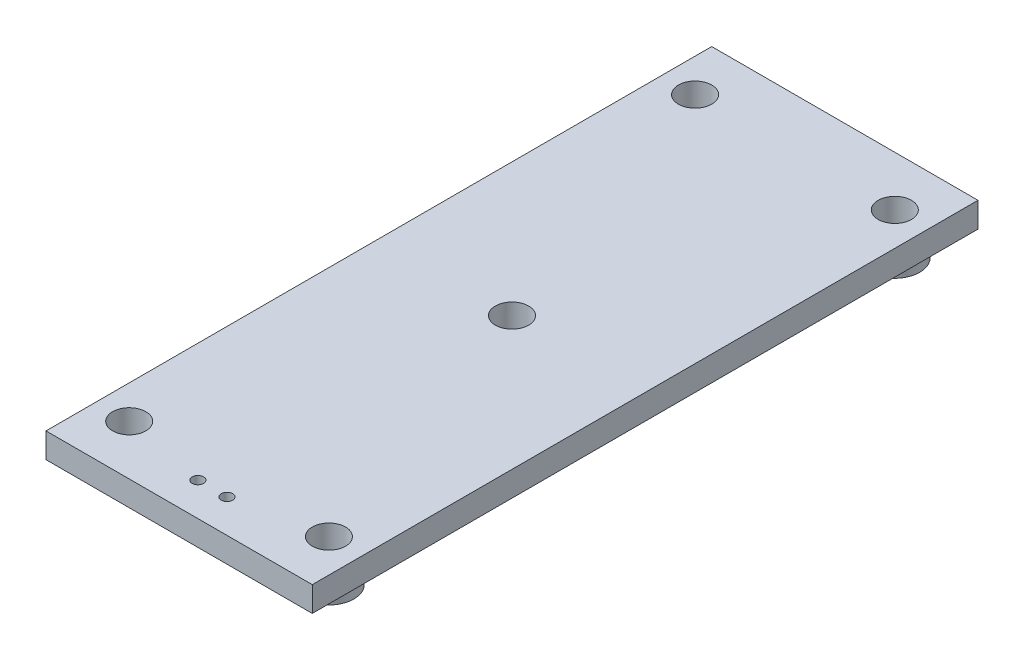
ISO-10303-21;
HEADER;
FILE_DESCRIPTION(('STEP AP214'),'2;1');
FILE_NAME('part.step','',(''),(''),'','','');
FILE_SCHEMA(('AUTOMOTIVE_DESIGN { 1 0 10303 214 1 1 1 1 }'));
ENDSEC;
DATA;
#1=APPLICATION_CONTEXT('core data for automotive mechanical design processes');
#2=APPLICATION_PROTOCOL_DEFINITION('international standard','automotive_design',2000,#1);
#3=PRODUCT_CONTEXT('',#1,'mechanical');
#4=PRODUCT('Part','Part','',(#3));
#5=PRODUCT_RELATED_PRODUCT_CATEGORY('part','',(#4));
#6=PRODUCT_DEFINITION_FORMATION('','',#4);
#7=PRODUCT_DEFINITION_CONTEXT('part definition',#1,'design');
#8=PRODUCT_DEFINITION('design','',#6,#7);
#9=PRODUCT_DEFINITION_SHAPE('','',#8);
#10=(LENGTH_UNIT() NAMED_UNIT(*) SI_UNIT(.MILLI.,.METRE.));
#11=(NAMED_UNIT(*) PLANE_ANGLE_UNIT() SI_UNIT($,.RADIAN.));
#12=(NAMED_UNIT(*) SI_UNIT($,.STERADIAN.) SOLID_ANGLE_UNIT());
#13=UNCERTAINTY_MEASURE_WITH_UNIT(LENGTH_MEASURE(1.E-05),#10,'distance_accuracy_value','');
#14=(GEOMETRIC_REPRESENTATION_CONTEXT(3) GLOBAL_UNCERTAINTY_ASSIGNED_CONTEXT((#13)) GLOBAL_UNIT_ASSIGNED_CONTEXT((#10,
#11,#12)) REPRESENTATION_CONTEXT('',''));
#15=CARTESIAN_POINT('',(0.,0.,0.));
#16=DIRECTION('',(0.,0.,1.));
#17=DIRECTION('',(1.,0.,0.));
#18=AXIS2_PLACEMENT_3D('',#15,#16,#17);
#19=CARTESIAN_POINT('',(101.6,0.,0.));
#20=DIRECTION('',(0.,-1.,0.));
#21=DIRECTION('',(0.,0.,-1.));
#22=AXIS2_PLACEMENT_3D('',#19,#20,#21);
#23=PLANE('',#22);
#24=CARTESIAN_POINT('',(-11.1125000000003,0.,482.6));
#25=DIRECTION('',(0.,-1.,0.));
#26=DIRECTION('',(0.,0.,-1.));
#27=AXIS2_PLACEMENT_3D('',#24,#25,#26);
#28=CIRCLE('',#27,4.365625);
#29=CARTESIAN_POINT('',(-11.1125000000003,0.,478.234375));
#30=VERTEX_POINT('',#29);
#31=EDGE_CURVE('E303',#30,#30,#28,.T.);
#32=ORIENTED_EDGE('',*,*,#31,.F.);
#33=EDGE_LOOP('',(#32));
#34=FACE_BOUND('',#33,.T.);
#35=CARTESIAN_POINT('',(11.1124999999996,0.,482.6));
#36=DIRECTION('',(0.,-1.,0.));
#37=DIRECTION('',(0.,0.,-1.));
#38=AXIS2_PLACEMENT_3D('',#35,#36,#37);
#39=CIRCLE('',#38,4.365625);
#40=CARTESIAN_POINT('',(11.1124999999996,0.,478.234375));
#41=VERTEX_POINT('',#40);
#42=EDGE_CURVE('E305',#41,#41,#39,.T.);
#43=ORIENTED_EDGE('',*,*,#42,.F.);
#44=EDGE_LOOP('',(#43));
#45=FACE_BOUND('',#44,.T.);
#46=CARTESIAN_POINT('',(0.,0.,254.));
#47=DIRECTION('',(0.,-1.,0.));
#48=DIRECTION('',(0.,0.,-1.));
#49=AXIS2_PLACEMENT_3D('',#46,#47,#48);
#50=CIRCLE('',#49,12.7);
#51=CARTESIAN_POINT('',(0.,0.,241.3));
#52=VERTEX_POINT('',#51);
#53=EDGE_CURVE('E316',#52,#52,#50,.T.);
#54=ORIENTED_EDGE('',*,*,#53,.F.);
#55=EDGE_LOOP('',(#54));
#56=FACE_BOUND('',#55,.T.);
#57=CARTESIAN_POINT('',(-76.2000000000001,0.,469.9));
#58=DIRECTION('',(0.,-1.,0.));
#59=DIRECTION('',(0.,0.,-1.));
#60=AXIS2_PLACEMENT_3D('',#57,#58,#59);
#61=CIRCLE('',#60,19.05);
#62=CARTESIAN_POINT('',(-76.2000000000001,0.,450.85));
#63=VERTEX_POINT('',#62);
#64=EDGE_CURVE('E11',#63,#63,#61,.T.);
#65=ORIENTED_EDGE('',*,*,#64,.F.);
#66=EDGE_LOOP('',(#65));
#67=FACE_BOUND('',#66,.T.);
#68=CARTESIAN_POINT('',(76.1999999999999,0.,469.9));
#69=DIRECTION('',(0.,-1.,0.));
#70=DIRECTION('',(0.,0.,-1.));
#71=AXIS2_PLACEMENT_3D('',#68,#69,#70);
#72=CIRCLE('',#71,19.05);
#73=CARTESIAN_POINT('',(76.1999999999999,0.,450.85));
#74=VERTEX_POINT('',#73);
#75=EDGE_CURVE('E95',#74,#74,#72,.T.);
#76=ORIENTED_EDGE('',*,*,#75,.F.);
#77=EDGE_LOOP('',(#76));
#78=FACE_BOUND('',#77,.T.);
#79=DIRECTION('',(0.,0.,1.));
#80=VECTOR('',#79,1.);
#81=CARTESIAN_POINT('',(101.6,0.,0.));
#82=LINE('',#81,#80);
#83=CARTESIAN_POINT('',(101.6,0.,0.));
#84=VERTEX_POINT('',#83);
#85=CARTESIAN_POINT('',(101.6,0.,508.));
#86=VERTEX_POINT('',#85);
#87=EDGE_CURVE('E74',#84,#86,#82,.T.);
#88=ORIENTED_EDGE('',*,*,#87,.T.);
#89=DIRECTION('',(1.,0.,0.));
#90=VECTOR('',#89,1.);
#91=CARTESIAN_POINT('',(-101.6,0.,508.));
#92=LINE('',#91,#90);
#93=CARTESIAN_POINT('',(-101.6,0.,508.));
#94=VERTEX_POINT('',#93);
#95=EDGE_CURVE('E81',#94,#86,#92,.T.);
#96=ORIENTED_EDGE('',*,*,#95,.F.);
#97=DIRECTION('',(0.,0.,-1.));
#98=VECTOR('',#97,1.);
#99=CARTESIAN_POINT('',(-101.6,0.,508.));
#100=LINE('',#99,#98);
#101=CARTESIAN_POINT('',(-101.6,0.,0.));
#102=VERTEX_POINT('',#101);
#103=EDGE_CURVE('E86',#94,#102,#100,.T.);
#104=ORIENTED_EDGE('',*,*,#103,.T.);
#105=DIRECTION('',(-1.,0.,0.));
#106=VECTOR('',#105,1.);
#107=CARTESIAN_POINT('',(101.6,0.,0.));
#108=LINE('',#107,#106);
#109=EDGE_CURVE('E91',#84,#102,#108,.T.);
#110=ORIENTED_EDGE('',*,*,#109,.F.);
#111=EDGE_LOOP('',(#88,#96,#104,#110));
#112=FACE_BOUND('',#111,.T.);
#113=CARTESIAN_POINT('',(76.1999999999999,0.,38.1));
#114=DIRECTION('',(0.,-1.,0.));
#115=DIRECTION('',(0.,0.,-1.));
#116=AXIS2_PLACEMENT_3D('',#113,#114,#115);
#117=CIRCLE('',#116,19.05);
#118=CARTESIAN_POINT('',(76.1999999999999,0.,19.05));
#119=VERTEX_POINT('',#118);
#120=EDGE_CURVE('E38',#119,#119,#117,.T.);
#121=ORIENTED_EDGE('',*,*,#120,.F.);
#122=EDGE_LOOP('',(#121));
#123=FACE_BOUND('',#122,.T.);
#124=CARTESIAN_POINT('',(-76.2000000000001,0.,38.1));
#125=DIRECTION('',(0.,-1.,0.));
#126=DIRECTION('',(0.,0.,-1.));
#127=AXIS2_PLACEMENT_3D('',#124,#125,#126);
#128=CIRCLE('',#127,19.05);
#129=CARTESIAN_POINT('',(-76.2000000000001,0.,19.05));
#130=VERTEX_POINT('',#129);
#131=EDGE_CURVE('E121',#130,#130,#128,.T.);
#132=ORIENTED_EDGE('',*,*,#131,.F.);
#133=EDGE_LOOP('',(#132));
#134=FACE_BOUND('',#133,.T.);
#135=ADVANCED_FACE('F30',(#34,#45,#56,#67,#78,#112,#123,#134),#23,.T.);
#136=CARTESIAN_POINT('',(101.6,19.05,0.));
#137=DIRECTION('',(1.,0.,0.));
#138=DIRECTION('',(0.,0.,-1.));
#139=AXIS2_PLACEMENT_3D('',#136,#137,#138);
#140=PLANE('',#139);
#141=ORIENTED_EDGE('',*,*,#87,.F.);
#142=DIRECTION('',(0.,-1.,0.));
#143=VECTOR('',#142,1.);
#144=CARTESIAN_POINT('',(101.6,19.05,0.));
#145=LINE('',#144,#143);
#146=CARTESIAN_POINT('',(101.6,19.05,0.));
#147=VERTEX_POINT('',#146);
#148=EDGE_CURVE('E45',#147,#84,#145,.T.);
#149=ORIENTED_EDGE('',*,*,#148,.F.);
#150=DIRECTION('',(0.,0.,1.));
#151=VECTOR('',#150,1.);
#152=CARTESIAN_POINT('',(101.6,19.05,0.));
#153=LINE('',#152,#151);
#154=CARTESIAN_POINT('',(101.6,19.05,508.));
#155=VERTEX_POINT('',#154);
#156=EDGE_CURVE('E75',#147,#155,#153,.T.);
#157=ORIENTED_EDGE('',*,*,#156,.T.);
#158=DIRECTION('',(0.,-1.,0.));
#159=VECTOR('',#158,1.);
#160=CARTESIAN_POINT('',(101.6,19.05,508.));
#161=LINE('',#160,#159);
#162=EDGE_CURVE('E71',#155,#86,#161,.T.);
#163=ORIENTED_EDGE('',*,*,#162,.T.);
#164=EDGE_LOOP('',(#141,#149,#157,#163));
#165=FACE_BOUND('',#164,.T.);
#166=ADVANCED_FACE('F32',(#165),#140,.T.);
#167=CARTESIAN_POINT('',(101.6,19.05,0.));
#168=DIRECTION('',(0.,0.,1.));
#169=DIRECTION('',(1.,0.,0.));
#170=AXIS2_PLACEMENT_3D('',#167,#168,#169);
#171=PLANE('',#170);
#172=ORIENTED_EDGE('',*,*,#109,.T.);
#173=DIRECTION('',(0.,-1.,0.));
#174=VECTOR('',#173,1.);
#175=CARTESIAN_POINT('',(-101.6,19.05,0.));
#176=LINE('',#175,#174);
#177=CARTESIAN_POINT('',(-101.6,19.05,0.));
#178=VERTEX_POINT('',#177);
#179=EDGE_CURVE('E109',#178,#102,#176,.T.);
#180=ORIENTED_EDGE('',*,*,#179,.F.);
#181=DIRECTION('',(-1.,0.,0.));
#182=VECTOR('',#181,1.);
#183=CARTESIAN_POINT('',(101.6,19.05,0.));
#184=LINE('',#183,#182);
#185=EDGE_CURVE('E52',#147,#178,#184,.T.);
#186=ORIENTED_EDGE('',*,*,#185,.F.);
#187=ORIENTED_EDGE('',*,*,#148,.T.);
#188=EDGE_LOOP('',(#172,#180,#186,#187));
#189=FACE_BOUND('',#188,.T.);
#190=ADVANCED_FACE('F158',(#189),#171,.F.);
#191=CARTESIAN_POINT('',(-101.6,19.05,508.));
#192=DIRECTION('',(-1.,0.,0.));
#193=DIRECTION('',(0.,0.,1.));
#194=AXIS2_PLACEMENT_3D('',#191,#192,#193);
#195=PLANE('',#194);
#196=ORIENTED_EDGE('',*,*,#103,.F.);
#197=DIRECTION('',(0.,-1.,0.));
#198=VECTOR('',#197,1.);
#199=CARTESIAN_POINT('',(-101.6,19.05,508.));
#200=LINE('',#199,#198);
#201=CARTESIAN_POINT('',(-101.6,19.05,508.));
#202=VERTEX_POINT('',#201);
#203=EDGE_CURVE('E78',#202,#94,#200,.T.);
#204=ORIENTED_EDGE('',*,*,#203,.F.);
#205=DIRECTION('',(0.,0.,-1.));
#206=VECTOR('',#205,1.);
#207=CARTESIAN_POINT('',(-101.6,19.05,508.));
#208=LINE('',#207,#206);
#209=EDGE_CURVE('E104',#202,#178,#208,.T.);
#210=ORIENTED_EDGE('',*,*,#209,.T.);
#211=ORIENTED_EDGE('',*,*,#179,.T.);
#212=EDGE_LOOP('',(#196,#204,#210,#211));
#213=FACE_BOUND('',#212,.T.);
#214=ADVANCED_FACE('F161',(#213),#195,.T.);
#215=CARTESIAN_POINT('',(-101.6,19.05,508.));
#216=DIRECTION('',(0.,0.,-1.));
#217=DIRECTION('',(-1.,0.,0.));
#218=AXIS2_PLACEMENT_3D('',#215,#216,#217);
#219=PLANE('',#218);
#220=ORIENTED_EDGE('',*,*,#95,.T.);
#221=ORIENTED_EDGE('',*,*,#162,.F.);
#222=DIRECTION('',(1.,0.,0.));
#223=VECTOR('',#222,1.);
#224=CARTESIAN_POINT('',(-101.6,19.05,508.));
#225=LINE('',#224,#223);
#226=EDGE_CURVE('E102',#202,#155,#225,.T.);
#227=ORIENTED_EDGE('',*,*,#226,.F.);
#228=ORIENTED_EDGE('',*,*,#203,.T.);
#229=EDGE_LOOP('',(#220,#221,#227,#228));
#230=FACE_BOUND('',#229,.T.);
#231=ADVANCED_FACE('F82',(#230),#219,.F.);
#232=CARTESIAN_POINT('',(101.6,19.05,0.));
#233=DIRECTION('',(0.,-1.,0.));
#234=DIRECTION('',(0.,0.,-1.));
#235=AXIS2_PLACEMENT_3D('',#232,#233,#234);
#236=PLANE('',#235);
#237=CARTESIAN_POINT('',(-11.1125000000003,19.05,482.6));
#238=DIRECTION('',(0.,-1.,0.));
#239=DIRECTION('',(0.,0.,-1.));
#240=AXIS2_PLACEMENT_3D('',#237,#238,#239);
#241=CIRCLE('',#240,4.365625);
#242=CARTESIAN_POINT('',(-11.1125000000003,19.05,478.234375));
#243=VERTEX_POINT('',#242);
#244=EDGE_CURVE('E300',#243,#243,#241,.T.);
#245=ORIENTED_EDGE('',*,*,#244,.T.);
#246=EDGE_LOOP('',(#245));
#247=FACE_BOUND('',#246,.T.);
#248=CARTESIAN_POINT('',(11.1124999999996,19.05,482.6));
#249=DIRECTION('',(0.,-1.,0.));
#250=DIRECTION('',(0.,0.,-1.));
#251=AXIS2_PLACEMENT_3D('',#248,#249,#250);
#252=CIRCLE('',#251,4.365625);
#253=CARTESIAN_POINT('',(11.1124999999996,19.05,478.234375));
#254=VERTEX_POINT('',#253);
#255=EDGE_CURVE('E310',#254,#254,#252,.T.);
#256=ORIENTED_EDGE('',*,*,#255,.T.);
#257=EDGE_LOOP('',(#256));
#258=FACE_BOUND('',#257,.T.);
#259=CARTESIAN_POINT('',(0.,19.05,254.));
#260=DIRECTION('',(0.,1.,0.));
#261=DIRECTION('',(0.,0.,1.));
#262=AXIS2_PLACEMENT_3D('',#259,#260,#261);
#263=CIRCLE('',#262,12.7);
#264=CARTESIAN_POINT('',(0.,19.05,266.7));
#265=VERTEX_POINT('',#264);
#266=EDGE_CURVE('E313',#265,#265,#263,.T.);
#267=ORIENTED_EDGE('',*,*,#266,.F.);
#268=EDGE_LOOP('',(#267));
#269=FACE_BOUND('',#268,.T.);
#270=CARTESIAN_POINT('',(-76.2000000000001,19.05,38.1));
#271=DIRECTION('',(0.,-1.,0.));
#272=DIRECTION('',(0.,0.,-1.));
#273=AXIS2_PLACEMENT_3D('',#270,#271,#272);
#274=CIRCLE('',#273,12.7);
#275=CARTESIAN_POINT('',(-76.2000000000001,19.05,25.4));
#276=VERTEX_POINT('',#275);
#277=EDGE_CURVE('E322',#276,#276,#274,.T.);
#278=ORIENTED_EDGE('',*,*,#277,.T.);
#279=EDGE_LOOP('',(#278));
#280=FACE_BOUND('',#279,.T.);
#281=CARTESIAN_POINT('',(76.1999999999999,19.05,38.1));
#282=DIRECTION('',(0.,-1.,0.));
#283=DIRECTION('',(0.,0.,-1.));
#284=AXIS2_PLACEMENT_3D('',#281,#282,#283);
#285=CIRCLE('',#284,12.7);
#286=CARTESIAN_POINT('',(76.1999999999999,19.05,25.4));
#287=VERTEX_POINT('',#286);
#288=EDGE_CURVE('E328',#287,#287,#285,.T.);
#289=ORIENTED_EDGE('',*,*,#288,.T.);
#290=EDGE_LOOP('',(#289));
#291=FACE_BOUND('',#290,.T.);
#292=CARTESIAN_POINT('',(-76.2000000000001,19.05,469.9));
#293=DIRECTION('',(0.,-1.,0.));
#294=DIRECTION('',(0.,0.,-1.));
#295=AXIS2_PLACEMENT_3D('',#292,#293,#294);
#296=CIRCLE('',#295,12.7);
#297=CARTESIAN_POINT('',(-76.2000000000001,19.05,457.2));
#298=VERTEX_POINT('',#297);
#299=EDGE_CURVE('E334',#298,#298,#296,.T.);
#300=ORIENTED_EDGE('',*,*,#299,.T.);
#301=EDGE_LOOP('',(#300));
#302=FACE_BOUND('',#301,.T.);
#303=CARTESIAN_POINT('',(76.1999999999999,19.05,469.9));
#304=DIRECTION('',(0.,-1.,0.));
#305=DIRECTION('',(0.,0.,-1.));
#306=AXIS2_PLACEMENT_3D('',#303,#304,#305);
#307=CIRCLE('',#306,12.7);
#308=CARTESIAN_POINT('',(76.1999999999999,19.05,457.2));
#309=VERTEX_POINT('',#308);
#310=EDGE_CURVE('E130',#309,#309,#307,.T.);
#311=ORIENTED_EDGE('',*,*,#310,.T.);
#312=EDGE_LOOP('',(#311));
#313=FACE_BOUND('',#312,.T.);
#314=ORIENTED_EDGE('',*,*,#156,.F.);
#315=ORIENTED_EDGE('',*,*,#185,.T.);
#316=ORIENTED_EDGE('',*,*,#209,.F.);
#317=ORIENTED_EDGE('',*,*,#226,.T.);
#318=EDGE_LOOP('',(#314,#315,#316,#317));
#319=FACE_BOUND('',#318,.T.);
#320=ADVANCED_FACE('F142',(#247,#258,#269,#280,#291,#302,#313,#319),#236,.F.);
#321=CARTESIAN_POINT('',(76.1999999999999,-12.7,469.9));
#322=DIRECTION('',(0.,1.,0.));
#323=DIRECTION('',(0.,0.,1.));
#324=AXIS2_PLACEMENT_3D('',#321,#322,#323);
#325=CYLINDRICAL_SURFACE('',#324,19.05);
#326=CARTESIAN_POINT('',(76.1999999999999,-12.7,469.9));
#327=DIRECTION('',(0.,-1.,0.));
#328=DIRECTION('',(0.,0.,-1.));
#329=AXIS2_PLACEMENT_3D('',#326,#327,#328);
#330=CIRCLE('',#329,19.05);
#331=CARTESIAN_POINT('',(76.1999999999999,-12.7,450.85));
#332=VERTEX_POINT('',#331);
#333=EDGE_CURVE('E92',#332,#332,#330,.T.);
#334=ORIENTED_EDGE('',*,*,#333,.F.);
#335=EDGE_LOOP('',(#334));
#336=FACE_BOUND('',#335,.T.);
#337=ORIENTED_EDGE('',*,*,#75,.T.);
#338=EDGE_LOOP('',(#337));
#339=FACE_BOUND('',#338,.T.);
#340=ADVANCED_FACE('F138',(#336,#339),#325,.T.);
#341=CARTESIAN_POINT('',(76.1999999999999,-12.7,469.9));
#342=DIRECTION('',(0.,-1.,0.));
#343=DIRECTION('',(0.,0.,-1.));
#344=AXIS2_PLACEMENT_3D('',#341,#342,#343);
#345=PLANE('',#344);
#346=CARTESIAN_POINT('',(76.1999999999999,-12.7,469.9));
#347=DIRECTION('',(0.,-1.,0.));
#348=DIRECTION('',(0.,0.,-1.));
#349=AXIS2_PLACEMENT_3D('',#346,#347,#348);
#350=CIRCLE('',#349,12.7);
#351=CARTESIAN_POINT('',(76.1999999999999,-12.7,457.2));
#352=VERTEX_POINT('',#351);
#353=EDGE_CURVE('E337',#352,#352,#350,.T.);
#354=ORIENTED_EDGE('',*,*,#353,.F.);
#355=EDGE_LOOP('',(#354));
#356=FACE_BOUND('',#355,.T.);
#357=ORIENTED_EDGE('',*,*,#333,.T.);
#358=EDGE_LOOP('',(#357));
#359=FACE_BOUND('',#358,.T.);
#360=ADVANCED_FACE('F141',(#356,#359),#345,.T.);
#361=CARTESIAN_POINT('',(76.1999999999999,-12.7,38.1));
#362=DIRECTION('',(0.,1.,0.));
#363=DIRECTION('',(0.,0.,1.));
#364=AXIS2_PLACEMENT_3D('',#361,#362,#363);
#365=CYLINDRICAL_SURFACE('',#364,19.05);
#366=CARTESIAN_POINT('',(76.1999999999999,-12.7,38.1));
#367=DIRECTION('',(0.,1.,0.));
#368=DIRECTION('',(0.,0.,1.));
#369=AXIS2_PLACEMENT_3D('',#366,#367,#368);
#370=CIRCLE('',#369,19.05);
#371=CARTESIAN_POINT('',(76.1999999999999,-12.7,57.15));
#372=VERTEX_POINT('',#371);
#373=EDGE_CURVE('E127',#372,#372,#370,.T.);
#374=ORIENTED_EDGE('',*,*,#373,.T.);
#375=EDGE_LOOP('',(#374));
#376=FACE_BOUND('',#375,.T.);
#377=ORIENTED_EDGE('',*,*,#120,.T.);
#378=EDGE_LOOP('',(#377));
#379=FACE_BOUND('',#378,.T.);
#380=ADVANCED_FACE('F114',(#376,#379),#365,.T.);
#381=CARTESIAN_POINT('',(76.1999999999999,-12.7,38.1));
#382=DIRECTION('',(0.,1.,0.));
#383=DIRECTION('',(0.,0.,1.));
#384=AXIS2_PLACEMENT_3D('',#381,#382,#383);
#385=PLANE('',#384);
#386=CARTESIAN_POINT('',(76.1999999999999,-12.7,38.1));
#387=DIRECTION('',(0.,-1.,0.));
#388=DIRECTION('',(0.,0.,-1.));
#389=AXIS2_PLACEMENT_3D('',#386,#387,#388);
#390=CIRCLE('',#389,12.7);
#391=CARTESIAN_POINT('',(76.1999999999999,-12.7,25.4));
#392=VERTEX_POINT('',#391);
#393=EDGE_CURVE('E325',#392,#392,#390,.T.);
#394=ORIENTED_EDGE('',*,*,#393,.F.);
#395=EDGE_LOOP('',(#394));
#396=FACE_BOUND('',#395,.T.);
#397=ORIENTED_EDGE('',*,*,#373,.F.);
#398=EDGE_LOOP('',(#397));
#399=FACE_BOUND('',#398,.T.);
#400=ADVANCED_FACE('F204',(#396,#399),#385,.F.);
#401=CARTESIAN_POINT('',(-76.2000000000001,-12.7,38.1));
#402=DIRECTION('',(0.,1.,0.));
#403=DIRECTION('',(0.,0.,1.));
#404=AXIS2_PLACEMENT_3D('',#401,#402,#403);
#405=CYLINDRICAL_SURFACE('',#404,19.05);
#406=CARTESIAN_POINT('',(-76.2000000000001,-12.7,38.1));
#407=DIRECTION('',(0.,-1.,0.));
#408=DIRECTION('',(0.,0.,-1.));
#409=AXIS2_PLACEMENT_3D('',#406,#407,#408);
#410=CIRCLE('',#409,19.05);
#411=CARTESIAN_POINT('',(-76.2000000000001,-12.7,19.05));
#412=VERTEX_POINT('',#411);
#413=EDGE_CURVE('E123',#412,#412,#410,.T.);
#414=ORIENTED_EDGE('',*,*,#413,.F.);
#415=EDGE_LOOP('',(#414));
#416=FACE_BOUND('',#415,.T.);
#417=ORIENTED_EDGE('',*,*,#131,.T.);
#418=EDGE_LOOP('',(#417));
#419=FACE_BOUND('',#418,.T.);
#420=ADVANCED_FACE('F211',(#416,#419),#405,.T.);
#421=CARTESIAN_POINT('',(-76.2000000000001,-12.7,38.1));
#422=DIRECTION('',(0.,-1.,0.));
#423=DIRECTION('',(0.,0.,-1.));
#424=AXIS2_PLACEMENT_3D('',#421,#422,#423);
#425=PLANE('',#424);
#426=CARTESIAN_POINT('',(-76.2000000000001,-12.7,38.1));
#427=DIRECTION('',(0.,-1.,0.));
#428=DIRECTION('',(0.,0.,-1.));
#429=AXIS2_PLACEMENT_3D('',#426,#427,#428);
#430=CIRCLE('',#429,12.7);
#431=CARTESIAN_POINT('',(-76.2000000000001,-12.7,25.4));
#432=VERTEX_POINT('',#431);
#433=EDGE_CURVE('E319',#432,#432,#430,.T.);
#434=ORIENTED_EDGE('',*,*,#433,.F.);
#435=EDGE_LOOP('',(#434));
#436=FACE_BOUND('',#435,.T.);
#437=ORIENTED_EDGE('',*,*,#413,.T.);
#438=EDGE_LOOP('',(#437));
#439=FACE_BOUND('',#438,.T.);
#440=ADVANCED_FACE('F219',(#436,#439),#425,.T.);
#441=CARTESIAN_POINT('',(-76.2000000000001,-12.7,469.9));
#442=DIRECTION('',(0.,1.,0.));
#443=DIRECTION('',(0.,0.,1.));
#444=AXIS2_PLACEMENT_3D('',#441,#442,#443);
#445=CYLINDRICAL_SURFACE('',#444,19.05);
#446=CARTESIAN_POINT('',(-76.2000000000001,-12.7,469.9));
#447=DIRECTION('',(0.,1.,0.));
#448=DIRECTION('',(0.,0.,1.));
#449=AXIS2_PLACEMENT_3D('',#446,#447,#448);
#450=CIRCLE('',#449,19.05);
#451=CARTESIAN_POINT('',(-76.2000000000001,-12.7,488.95));
#452=VERTEX_POINT('',#451);
#453=EDGE_CURVE('E124',#452,#452,#450,.T.);
#454=ORIENTED_EDGE('',*,*,#453,.T.);
#455=EDGE_LOOP('',(#454));
#456=FACE_BOUND('',#455,.T.);
#457=ORIENTED_EDGE('',*,*,#64,.T.);
#458=EDGE_LOOP('',(#457));
#459=FACE_BOUND('',#458,.T.);
#460=ADVANCED_FACE('F226',(#456,#459),#445,.T.);
#461=CARTESIAN_POINT('',(-76.2000000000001,-12.7,469.9));
#462=DIRECTION('',(0.,1.,0.));
#463=DIRECTION('',(0.,0.,1.));
#464=AXIS2_PLACEMENT_3D('',#461,#462,#463);
#465=PLANE('',#464);
#466=CARTESIAN_POINT('',(-76.2000000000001,-12.7,469.9));
#467=DIRECTION('',(0.,-1.,0.));
#468=DIRECTION('',(0.,0.,-1.));
#469=AXIS2_PLACEMENT_3D('',#466,#467,#468);
#470=CIRCLE('',#469,12.7);
#471=CARTESIAN_POINT('',(-76.2000000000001,-12.7,457.2));
#472=VERTEX_POINT('',#471);
#473=EDGE_CURVE('E331',#472,#472,#470,.T.);
#474=ORIENTED_EDGE('',*,*,#473,.F.);
#475=EDGE_LOOP('',(#474));
#476=FACE_BOUND('',#475,.T.);
#477=ORIENTED_EDGE('',*,*,#453,.F.);
#478=EDGE_LOOP('',(#477));
#479=FACE_BOUND('',#478,.T.);
#480=ADVANCED_FACE('F234',(#476,#479),#465,.F.);
#481=CARTESIAN_POINT('',(76.1999999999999,19.05,469.9));
#482=DIRECTION('',(0.,-1.,0.));
#483=DIRECTION('',(0.,0.,-1.));
#484=AXIS2_PLACEMENT_3D('',#481,#482,#483);
#485=CYLINDRICAL_SURFACE('',#484,12.7);
#486=ORIENTED_EDGE('',*,*,#310,.F.);
#487=EDGE_LOOP('',(#486));
#488=FACE_BOUND('',#487,.T.);
#489=ORIENTED_EDGE('',*,*,#353,.T.);
#490=EDGE_LOOP('',(#489));
#491=FACE_BOUND('',#490,.T.);
#492=ADVANCED_FACE('F241',(#488,#491),#485,.F.);
#493=CARTESIAN_POINT('',(-76.2000000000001,19.05,469.9));
#494=DIRECTION('',(0.,-1.,0.));
#495=DIRECTION('',(0.,0.,-1.));
#496=AXIS2_PLACEMENT_3D('',#493,#494,#495);
#497=CYLINDRICAL_SURFACE('',#496,12.7);
#498=ORIENTED_EDGE('',*,*,#299,.F.);
#499=EDGE_LOOP('',(#498));
#500=FACE_BOUND('',#499,.T.);
#501=ORIENTED_EDGE('',*,*,#473,.T.);
#502=EDGE_LOOP('',(#501));
#503=FACE_BOUND('',#502,.T.);
#504=ADVANCED_FACE('F249',(#500,#503),#497,.F.);
#505=CARTESIAN_POINT('',(76.1999999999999,19.05,38.1));
#506=DIRECTION('',(0.,-1.,0.));
#507=DIRECTION('',(0.,0.,-1.));
#508=AXIS2_PLACEMENT_3D('',#505,#506,#507);
#509=CYLINDRICAL_SURFACE('',#508,12.7);
#510=ORIENTED_EDGE('',*,*,#288,.F.);
#511=EDGE_LOOP('',(#510));
#512=FACE_BOUND('',#511,.T.);
#513=ORIENTED_EDGE('',*,*,#393,.T.);
#514=EDGE_LOOP('',(#513));
#515=FACE_BOUND('',#514,.T.);
#516=ADVANCED_FACE('F257',(#512,#515),#509,.F.);
#517=CARTESIAN_POINT('',(-76.2000000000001,19.05,38.1));
#518=DIRECTION('',(0.,-1.,0.));
#519=DIRECTION('',(0.,0.,-1.));
#520=AXIS2_PLACEMENT_3D('',#517,#518,#519);
#521=CYLINDRICAL_SURFACE('',#520,12.7);
#522=ORIENTED_EDGE('',*,*,#277,.F.);
#523=EDGE_LOOP('',(#522));
#524=FACE_BOUND('',#523,.T.);
#525=ORIENTED_EDGE('',*,*,#433,.T.);
#526=EDGE_LOOP('',(#525));
#527=FACE_BOUND('',#526,.T.);
#528=ADVANCED_FACE('F265',(#524,#527),#521,.F.);
#529=CARTESIAN_POINT('',(0.,-12.7,254.));
#530=DIRECTION('',(0.,1.,0.));
#531=DIRECTION('',(0.,0.,1.));
#532=AXIS2_PLACEMENT_3D('',#529,#530,#531);
#533=CYLINDRICAL_SURFACE('',#532,12.7);
#534=ORIENTED_EDGE('',*,*,#53,.T.);
#535=EDGE_LOOP('',(#534));
#536=FACE_BOUND('',#535,.T.);
#537=ORIENTED_EDGE('',*,*,#266,.T.);
#538=EDGE_LOOP('',(#537));
#539=FACE_BOUND('',#538,.T.);
#540=ADVANCED_FACE('F273',(#536,#539),#533,.F.);
#541=CARTESIAN_POINT('',(11.1124999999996,19.05,482.6));
#542=DIRECTION('',(0.,-1.,0.));
#543=DIRECTION('',(0.,0.,-1.));
#544=AXIS2_PLACEMENT_3D('',#541,#542,#543);
#545=CYLINDRICAL_SURFACE('',#544,4.365625);
#546=CARTESIAN_POINT('',(11.1124999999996,19.05,478.234375));
#547=CARTESIAN_POINT('',(11.1124999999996,18.8515625,478.234375));
#548=CARTESIAN_POINT('',(11.1124999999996,18.653125,478.234375));
#549=CARTESIAN_POINT('',(11.1124999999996,18.25625,478.234375));
#550=CARTESIAN_POINT('',(11.1124999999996,18.0578125,478.234375));
#551=CARTESIAN_POINT('',(11.1124999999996,17.6609375,478.234375));
#552=CARTESIAN_POINT('',(11.1124999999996,17.4625,478.234375));
#553=CARTESIAN_POINT('',(11.1124999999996,17.065625,478.234375));
#554=CARTESIAN_POINT('',(11.1124999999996,16.8671875,478.234375));
#555=CARTESIAN_POINT('',(11.1124999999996,16.4703125,478.234375));
#556=CARTESIAN_POINT('',(11.1124999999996,16.271875,478.234375));
#557=CARTESIAN_POINT('',(11.1124999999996,15.875,478.234375));
#558=CARTESIAN_POINT('',(11.1124999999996,15.6765625,478.234375));
#559=CARTESIAN_POINT('',(11.1124999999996,15.2796875,478.234375));
#560=CARTESIAN_POINT('',(11.1124999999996,15.08125,478.234375));
#561=CARTESIAN_POINT('',(11.1124999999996,14.684375,478.234375));
#562=CARTESIAN_POINT('',(11.1124999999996,14.4859375,478.234375));
#563=CARTESIAN_POINT('',(11.1124999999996,14.0890625,478.234375));
#564=CARTESIAN_POINT('',(11.1124999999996,13.890625,478.234375));
#565=CARTESIAN_POINT('',(11.1124999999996,13.49375,478.234375));
#566=CARTESIAN_POINT('',(11.1124999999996,13.2953125,478.234375));
#567=CARTESIAN_POINT('',(11.1124999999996,12.8984375,478.234375));
#568=CARTESIAN_POINT('',(11.1124999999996,12.7,478.234375));
#569=CARTESIAN_POINT('',(11.1124999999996,12.303125,478.234375));
#570=CARTESIAN_POINT('',(11.1124999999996,12.1046875,478.234375));
#571=CARTESIAN_POINT('',(11.1124999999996,11.7078125,478.234375));
#572=CARTESIAN_POINT('',(11.1124999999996,11.509375,478.234375));
#573=CARTESIAN_POINT('',(11.1124999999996,11.1125,478.234375));
#574=CARTESIAN_POINT('',(11.1124999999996,10.9140625,478.234375));
#575=CARTESIAN_POINT('',(11.1124999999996,10.5171875,478.234375));
#576=CARTESIAN_POINT('',(11.1124999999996,10.31875,478.234375));
#577=CARTESIAN_POINT('',(11.1124999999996,9.921875,478.234375));
#578=CARTESIAN_POINT('',(11.1124999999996,9.7234375,478.234375));
#579=CARTESIAN_POINT('',(11.1124999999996,9.3265625,478.234375));
#580=CARTESIAN_POINT('',(11.1124999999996,9.128125,478.234375));
#581=CARTESIAN_POINT('',(11.1124999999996,8.73125,478.234375));
#582=CARTESIAN_POINT('',(11.1124999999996,8.5328125,478.234375));
#583=CARTESIAN_POINT('',(11.1124999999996,8.1359375,478.234375));
#584=CARTESIAN_POINT('',(11.1124999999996,7.9375,478.234375));
#585=CARTESIAN_POINT('',(11.1124999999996,7.540625,478.234375));
#586=CARTESIAN_POINT('',(11.1124999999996,7.3421875,478.234375));
#587=CARTESIAN_POINT('',(11.1124999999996,6.9453125,478.234375));
#588=CARTESIAN_POINT('',(11.1124999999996,6.746875,478.234375));
#589=CARTESIAN_POINT('',(11.1124999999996,6.35,478.234375));
#590=CARTESIAN_POINT('',(11.1124999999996,6.1515625,478.234375));
#591=CARTESIAN_POINT('',(11.1124999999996,5.7546875,478.234375));
#592=CARTESIAN_POINT('',(11.1124999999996,5.55625,478.234375));
#593=CARTESIAN_POINT('',(11.1124999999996,5.159375,478.234375));
#594=CARTESIAN_POINT('',(11.1124999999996,4.9609375,478.234375));
#595=CARTESIAN_POINT('',(11.1124999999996,4.5640625,478.234375));
#596=CARTESIAN_POINT('',(11.1124999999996,4.365625,478.234375));
#597=CARTESIAN_POINT('',(11.1124999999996,3.96875,478.234375));
#598=CARTESIAN_POINT('',(11.1124999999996,3.7703125,478.234375));
#599=CARTESIAN_POINT('',(11.1124999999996,3.3734375,478.234375));
#600=CARTESIAN_POINT('',(11.1124999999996,3.175,478.234375));
#601=CARTESIAN_POINT('',(11.1124999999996,2.778125,478.234375));
#602=CARTESIAN_POINT('',(11.1124999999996,2.5796875,478.234375));
#603=CARTESIAN_POINT('',(11.1124999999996,2.1828125,478.234375));
#604=CARTESIAN_POINT('',(11.1124999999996,1.984375,478.234375));
#605=CARTESIAN_POINT('',(11.1124999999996,1.5875,478.234375));
#606=CARTESIAN_POINT('',(11.1124999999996,1.3890625,478.234375));
#607=CARTESIAN_POINT('',(11.1124999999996,0.992187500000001,478.234375));
#608=CARTESIAN_POINT('',(11.1124999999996,0.793750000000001,478.234375));
#609=CARTESIAN_POINT('',(11.1124999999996,0.396875,478.234375));
#610=CARTESIAN_POINT('',(11.1124999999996,0.1984375,478.234375));
#611=CARTESIAN_POINT('',(11.1124999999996,0.,478.234375));
#612=B_SPLINE_CURVE_WITH_KNOTS('',3,(#546,#547,#548,#549,#550,#551,#552,#553,#554,#555,#556,
#557,#558,#559,#560,#561,#562,#563,#564,#565,#566,#567,#568,#569,#570,#571,#572,#573,#574,#575,
#576,#577,#578,#579,#580,#581,#582,#583,#584,#585,#586,#587,#588,#589,#590,#591,#592,#593,#594,
#595,#596,#597,#598,#599,#600,#601,#602,#603,#604,#605,#606,#607,#608,#609,#610,#611),
.UNSPECIFIED.,.F.,.F.,(4,2,2,2,2,2,2,2,2,2,2,2,2,2,2,2,2,2,2,2,2,2,2,2,2,2,2,2,2,2,2,2,4),(0.,
0.5953125,1.190625,1.7859375,2.38125,2.9765625,3.571875,4.1671875,4.7625,5.3578125,5.953125,
6.5484375,7.14375,7.7390625,8.334375,8.9296875,9.525,10.1203125,10.715625,11.3109375,11.90625,
12.5015625,13.096875,13.6921875,14.2875,14.8828125,15.478125,16.0734375,16.66875,17.2640625,
17.859375,18.4546875,19.05),.UNSPECIFIED.);
#613=EDGE_CURVE('BSEAM280',#254,#41,#612,.T.);
#614=ORIENTED_EDGE('',*,*,#255,.F.);
#615=ORIENTED_EDGE('',*,*,#42,.T.);
#616=ORIENTED_EDGE('',*,*,#613,.T.);
#617=ORIENTED_EDGE('',*,*,#613,.F.);
#618=EDGE_LOOP('',(#614,#616,#615,#617));
#619=FACE_BOUND('',#618,.T.);
#620=ADVANCED_FACE('F280',(#619),#545,.F.);
#621=CARTESIAN_POINT('',(-11.1125000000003,19.05,482.6));
#622=DIRECTION('',(0.,-1.,0.));
#623=DIRECTION('',(0.,0.,-1.));
#624=AXIS2_PLACEMENT_3D('',#621,#622,#623);
#625=CYLINDRICAL_SURFACE('',#624,4.365625);
#626=CARTESIAN_POINT('',(-11.1125000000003,19.05,478.234375));
#627=CARTESIAN_POINT('',(-11.1125000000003,18.8515625,478.234375));
#628=CARTESIAN_POINT('',(-11.1125000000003,18.653125,478.234375));
#629=CARTESIAN_POINT('',(-11.1125000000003,18.25625,478.234375));
#630=CARTESIAN_POINT('',(-11.1125000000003,18.0578125,478.234375));
#631=CARTESIAN_POINT('',(-11.1125000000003,17.6609375,478.234375));
#632=CARTESIAN_POINT('',(-11.1125000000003,17.4625,478.234375));
#633=CARTESIAN_POINT('',(-11.1125000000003,17.065625,478.234375));
#634=CARTESIAN_POINT('',(-11.1125000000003,16.8671875,478.234375));
#635=CARTESIAN_POINT('',(-11.1125000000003,16.4703125,478.234375));
#636=CARTESIAN_POINT('',(-11.1125000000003,16.271875,478.234375));
#637=CARTESIAN_POINT('',(-11.1125000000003,15.875,478.234375));
#638=CARTESIAN_POINT('',(-11.1125000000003,15.6765625,478.234375));
#639=CARTESIAN_POINT('',(-11.1125000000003,15.2796875,478.234375));
#640=CARTESIAN_POINT('',(-11.1125000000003,15.08125,478.234375));
#641=CARTESIAN_POINT('',(-11.1125000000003,14.684375,478.234375));
#642=CARTESIAN_POINT('',(-11.1125000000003,14.4859375,478.234375));
#643=CARTESIAN_POINT('',(-11.1125000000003,14.0890625,478.234375));
#644=CARTESIAN_POINT('',(-11.1125000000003,13.890625,478.234375));
#645=CARTESIAN_POINT('',(-11.1125000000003,13.49375,478.234375));
#646=CARTESIAN_POINT('',(-11.1125000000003,13.2953125,478.234375));
#647=CARTESIAN_POINT('',(-11.1125000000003,12.8984375,478.234375));
#648=CARTESIAN_POINT('',(-11.1125000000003,12.7,478.234375));
#649=CARTESIAN_POINT('',(-11.1125000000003,12.303125,478.234375));
#650=CARTESIAN_POINT('',(-11.1125000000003,12.1046875,478.234375));
#651=CARTESIAN_POINT('',(-11.1125000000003,11.7078125,478.234375));
#652=CARTESIAN_POINT('',(-11.1125000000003,11.509375,478.234375));
#653=CARTESIAN_POINT('',(-11.1125000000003,11.1125,478.234375));
#654=CARTESIAN_POINT('',(-11.1125000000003,10.9140625,478.234375));
#655=CARTESIAN_POINT('',(-11.1125000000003,10.5171875,478.234375));
#656=CARTESIAN_POINT('',(-11.1125000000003,10.31875,478.234375));
#657=CARTESIAN_POINT('',(-11.1125000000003,9.921875,478.234375));
#658=CARTESIAN_POINT('',(-11.1125000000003,9.7234375,478.234375));
#659=CARTESIAN_POINT('',(-11.1125000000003,9.3265625,478.234375));
#660=CARTESIAN_POINT('',(-11.1125000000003,9.128125,478.234375));
#661=CARTESIAN_POINT('',(-11.1125000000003,8.73125,478.234375));
#662=CARTESIAN_POINT('',(-11.1125000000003,8.5328125,478.234375));
#663=CARTESIAN_POINT('',(-11.1125000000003,8.1359375,478.234375));
#664=CARTESIAN_POINT('',(-11.1125000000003,7.9375,478.234375));
#665=CARTESIAN_POINT('',(-11.1125000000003,7.540625,478.234375));
#666=CARTESIAN_POINT('',(-11.1125000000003,7.3421875,478.234375));
#667=CARTESIAN_POINT('',(-11.1125000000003,6.9453125,478.234375));
#668=CARTESIAN_POINT('',(-11.1125000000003,6.746875,478.234375));
#669=CARTESIAN_POINT('',(-11.1125000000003,6.35,478.234375));
#670=CARTESIAN_POINT('',(-11.1125000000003,6.1515625,478.234375));
#671=CARTESIAN_POINT('',(-11.1125000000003,5.7546875,478.234375));
#672=CARTESIAN_POINT('',(-11.1125000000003,5.55625,478.234375));
#673=CARTESIAN_POINT('',(-11.1125000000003,5.159375,478.234375));
#674=CARTESIAN_POINT('',(-11.1125000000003,4.9609375,478.234375));
#675=CARTESIAN_POINT('',(-11.1125000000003,4.5640625,478.234375));
#676=CARTESIAN_POINT('',(-11.1125000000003,4.365625,478.234375));
#677=CARTESIAN_POINT('',(-11.1125000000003,3.96875,478.234375));
#678=CARTESIAN_POINT('',(-11.1125000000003,3.7703125,478.234375));
#679=CARTESIAN_POINT('',(-11.1125000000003,3.3734375,478.234375));
#680=CARTESIAN_POINT('',(-11.1125000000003,3.175,478.234375));
#681=CARTESIAN_POINT('',(-11.1125000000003,2.778125,478.234375));
#682=CARTESIAN_POINT('',(-11.1125000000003,2.5796875,478.234375));
#683=CARTESIAN_POINT('',(-11.1125000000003,2.1828125,478.234375));
#684=CARTESIAN_POINT('',(-11.1125000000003,1.984375,478.234375));
#685=CARTESIAN_POINT('',(-11.1125000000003,1.5875,478.234375));
#686=CARTESIAN_POINT('',(-11.1125000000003,1.3890625,478.234375));
#687=CARTESIAN_POINT('',(-11.1125000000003,0.992187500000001,478.234375));
#688=CARTESIAN_POINT('',(-11.1125000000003,0.793750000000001,478.234375));
#689=CARTESIAN_POINT('',(-11.1125000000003,0.396875,478.234375));
#690=CARTESIAN_POINT('',(-11.1125000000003,0.1984375,478.234375));
#691=CARTESIAN_POINT('',(-11.1125000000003,0.,478.234375));
#692=B_SPLINE_CURVE_WITH_KNOTS('',3,(#626,#627,#628,#629,#630,#631,#632,#633,#634,#635,#636,
#637,#638,#639,#640,#641,#642,#643,#644,#645,#646,#647,#648,#649,#650,#651,#652,#653,#654,#655,
#656,#657,#658,#659,#660,#661,#662,#663,#664,#665,#666,#667,#668,#669,#670,#671,#672,#673,#674,
#675,#676,#677,#678,#679,#680,#681,#682,#683,#684,#685,#686,#687,#688,#689,#690,#691),
.UNSPECIFIED.,.F.,.F.,(4,2,2,2,2,2,2,2,2,2,2,2,2,2,2,2,2,2,2,2,2,2,2,2,2,2,2,2,2,2,2,2,4),(0.,
0.5953125,1.190625,1.7859375,2.38125,2.9765625,3.571875,4.1671875,4.7625,5.3578125,5.953125,
6.5484375,7.14375,7.7390625,8.334375,8.9296875,9.525,10.1203125,10.715625,11.3109375,11.90625,
12.5015625,13.096875,13.6921875,14.2875,14.8828125,15.478125,16.0734375,16.66875,17.2640625,
17.859375,18.4546875,19.05),.UNSPECIFIED.);
#693=EDGE_CURVE('BSEAM287',#243,#30,#692,.T.);
#694=ORIENTED_EDGE('',*,*,#244,.F.);
#695=ORIENTED_EDGE('',*,*,#31,.T.);
#696=ORIENTED_EDGE('',*,*,#693,.T.);
#697=ORIENTED_EDGE('',*,*,#693,.F.);
#698=EDGE_LOOP('',(#694,#696,#695,#697));
#699=FACE_BOUND('',#698,.T.);
#700=ADVANCED_FACE('F287',(#699),#625,.F.);
#701=CLOSED_SHELL('',(#135,#166,#190,#214,#231,#320,#340,#360,#380,#400,#420,#440,#460,#480,
#492,#504,#516,#528,#540,#620,#700));
#702=MANIFOLD_SOLID_BREP('B2',#701);
#703=ADVANCED_BREP_SHAPE_REPRESENTATION('',(#18,#702),#14);
#704=SHAPE_DEFINITION_REPRESENTATION(#9,#703);
ENDSEC;
END-ISO-10303-21;
